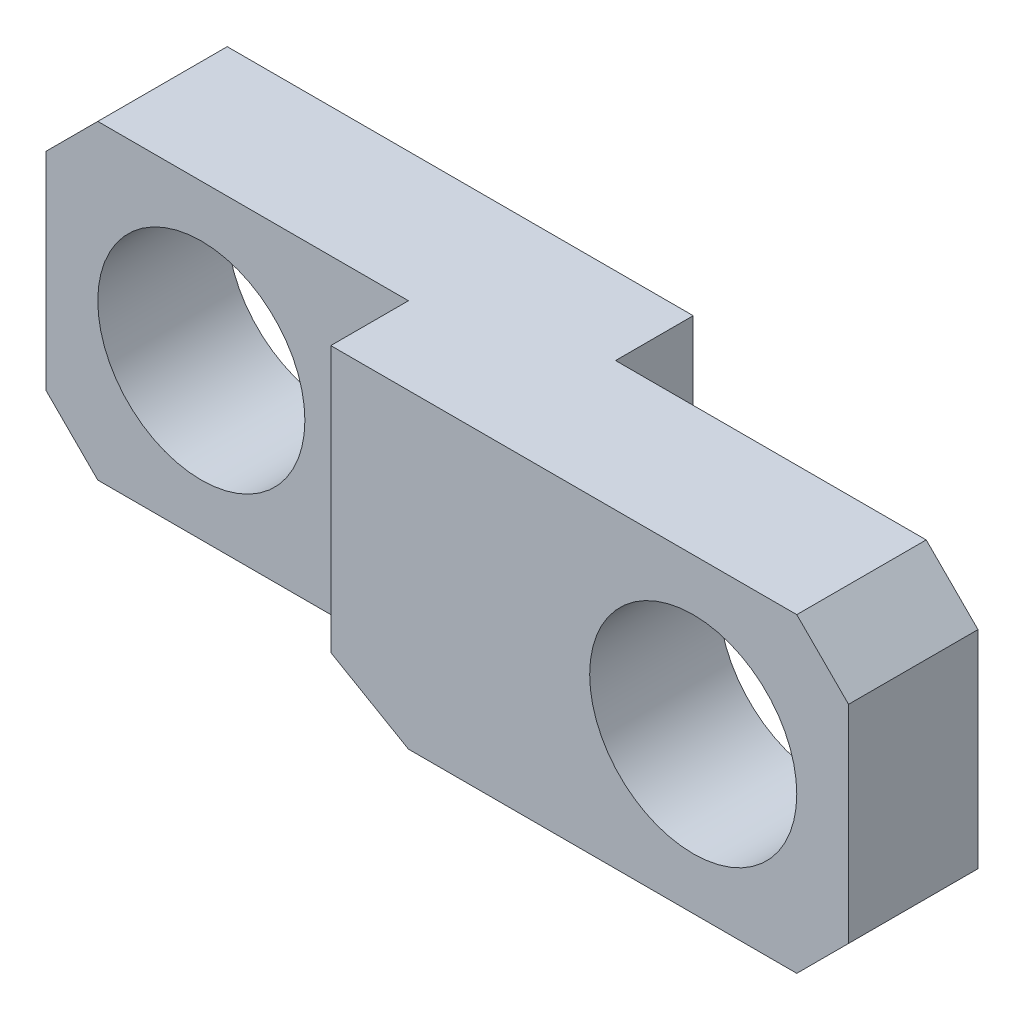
ISO-10303-21;
HEADER;
FILE_DESCRIPTION(('STEP AP214'),'2;1');
FILE_NAME('part.step','',(''),(''),'','','');
FILE_SCHEMA(('AUTOMOTIVE_DESIGN { 1 0 10303 214 1 1 1 1 }'));
ENDSEC;
DATA;
#1=APPLICATION_CONTEXT('core data for automotive mechanical design processes');
#2=APPLICATION_PROTOCOL_DEFINITION('international standard','automotive_design',2000,#1);
#3=PRODUCT_CONTEXT('',#1,'mechanical');
#4=PRODUCT('Part','Part','',(#3));
#5=PRODUCT_RELATED_PRODUCT_CATEGORY('part','',(#4));
#6=PRODUCT_DEFINITION_FORMATION('','',#4);
#7=PRODUCT_DEFINITION_CONTEXT('part definition',#1,'design');
#8=PRODUCT_DEFINITION('design','',#6,#7);
#9=PRODUCT_DEFINITION_SHAPE('','',#8);
#10=(LENGTH_UNIT() NAMED_UNIT(*) SI_UNIT(.MILLI.,.METRE.));
#11=(NAMED_UNIT(*) PLANE_ANGLE_UNIT() SI_UNIT($,.RADIAN.));
#12=(NAMED_UNIT(*) SI_UNIT($,.STERADIAN.) SOLID_ANGLE_UNIT());
#13=UNCERTAINTY_MEASURE_WITH_UNIT(LENGTH_MEASURE(1.E-05),#10,'distance_accuracy_value','');
#14=(GEOMETRIC_REPRESENTATION_CONTEXT(3) GLOBAL_UNCERTAINTY_ASSIGNED_CONTEXT((#13)) GLOBAL_UNIT_ASSIGNED_CONTEXT((#10,
#11,#12)) REPRESENTATION_CONTEXT('',''));
#15=CARTESIAN_POINT('',(0.,0.,0.));
#16=DIRECTION('',(0.,0.,1.));
#17=DIRECTION('',(1.,0.,0.));
#18=AXIS2_PLACEMENT_3D('',#15,#16,#17);
#19=CARTESIAN_POINT('',(-30.,30.,0.));
#20=DIRECTION('',(0.,0.,1.));
#21=DIRECTION('',(1.,0.,0.));
#22=AXIS2_PLACEMENT_3D('',#19,#20,#21);
#23=PLANE('',#22);
#24=CARTESIAN_POINT('',(-24.,24.,0.));
#25=DIRECTION('',(0.,0.,1.));
#26=DIRECTION('',(1.,0.,0.));
#27=AXIS2_PLACEMENT_3D('',#24,#25,#26);
#28=CIRCLE('',#27,4.);
#29=CARTESIAN_POINT('',(-20.,24.,0.));
#30=VERTEX_POINT('',#29);
#31=EDGE_CURVE('E225',#30,#30,#28,.T.);
#32=ORIENTED_EDGE('',*,*,#31,.T.);
#33=EDGE_LOOP('',(#32));
#34=FACE_BOUND('',#33,.T.);
#35=DIRECTION('',(0.,-1.,0.));
#36=VECTOR('',#35,1.);
#37=CARTESIAN_POINT('',(-10.,30.,0.));
#38=LINE('',#37,#36);
#39=CARTESIAN_POINT('',(-10.,30.,0.));
#40=VERTEX_POINT('',#39);
#41=CARTESIAN_POINT('',(-10.,18.,0.));
#42=VERTEX_POINT('',#41);
#43=EDGE_CURVE('E118',#40,#42,#38,.T.);
#44=ORIENTED_EDGE('',*,*,#43,.T.);
#45=DIRECTION('',(-1.,0.,0.));
#46=VECTOR('',#45,1.);
#47=CARTESIAN_POINT('',(4.,18.,0.));
#48=LINE('',#47,#46);
#49=CARTESIAN_POINT('',(-28.,18.,0.));
#50=VERTEX_POINT('',#49);
#51=EDGE_CURVE('E146',#42,#50,#48,.T.);
#52=ORIENTED_EDGE('',*,*,#51,.T.);
#53=DIRECTION('',(-0.707106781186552,0.707106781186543,0.));
#54=VECTOR('',#53,1.);
#55=CARTESIAN_POINT('',(-28.,18.,0.));
#56=LINE('',#55,#54);
#57=CARTESIAN_POINT('',(-30.,20.,0.));
#58=VERTEX_POINT('',#57);
#59=EDGE_CURVE('E180',#50,#58,#56,.T.);
#60=ORIENTED_EDGE('',*,*,#59,.T.);
#61=DIRECTION('',(0.,-1.,0.));
#62=VECTOR('',#61,1.);
#63=CARTESIAN_POINT('',(-30.,30.,0.));
#64=LINE('',#63,#62);
#65=CARTESIAN_POINT('',(-30.,28.,0.));
#66=VERTEX_POINT('',#65);
#67=EDGE_CURVE('E150',#66,#58,#64,.T.);
#68=ORIENTED_EDGE('',*,*,#67,.F.);
#69=DIRECTION('',(0.707106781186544,0.707106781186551,0.));
#70=VECTOR('',#69,1.);
#71=CARTESIAN_POINT('',(-30.,28.,0.));
#72=LINE('',#71,#70);
#73=CARTESIAN_POINT('',(-28.,30.,0.));
#74=VERTEX_POINT('',#73);
#75=EDGE_CURVE('E144',#66,#74,#72,.T.);
#76=ORIENTED_EDGE('',*,*,#75,.T.);
#77=DIRECTION('',(1.,0.,0.));
#78=VECTOR('',#77,1.);
#79=CARTESIAN_POINT('',(-30.,30.,0.));
#80=LINE('',#79,#78);
#81=EDGE_CURVE('E136',#74,#40,#80,.T.);
#82=ORIENTED_EDGE('',*,*,#81,.T.);
#83=EDGE_LOOP('',(#44,#52,#60,#68,#76,#82));
#84=FACE_BOUND('',#83,.T.);
#85=ADVANCED_FACE('F24',(#34,#84),#23,.F.);
#86=CARTESIAN_POINT('',(4.,18.,8.));
#87=DIRECTION('',(0.,-1.,0.));
#88=DIRECTION('',(1.,0.,0.));
#89=AXIS2_PLACEMENT_3D('',#86,#87,#88);
#90=PLANE('',#89);
#91=DIRECTION('',(-1.,0.,0.));
#92=VECTOR('',#91,1.);
#93=CARTESIAN_POINT('',(4.,18.,8.));
#94=LINE('',#93,#92);
#95=CARTESIAN_POINT('',(1.99999999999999,18.,8.));
#96=VERTEX_POINT('',#95);
#97=CARTESIAN_POINT('',(-13.,18.,8.));
#98=VERTEX_POINT('',#97);
#99=EDGE_CURVE('E145',#96,#98,#94,.T.);
#100=ORIENTED_EDGE('',*,*,#99,.T.);
#101=DIRECTION('',(0.,0.,-1.));
#102=VECTOR('',#101,1.);
#103=CARTESIAN_POINT('',(-13.,18.,5.));
#104=LINE('',#103,#102);
#105=CARTESIAN_POINT('',(-13.,18.,5.));
#106=VERTEX_POINT('',#105);
#107=EDGE_CURVE('E32',#98,#106,#104,.T.);
#108=ORIENTED_EDGE('',*,*,#107,.T.);
#109=DIRECTION('',(-1.,0.,0.));
#110=VECTOR('',#109,1.);
#111=CARTESIAN_POINT('',(-16.,18.,5.));
#112=LINE('',#111,#110);
#113=CARTESIAN_POINT('',(-28.,18.,5.));
#114=VERTEX_POINT('',#113);
#115=EDGE_CURVE('E38',#106,#114,#112,.T.);
#116=ORIENTED_EDGE('',*,*,#115,.T.);
#117=DIRECTION('',(0.,0.,-1.));
#118=VECTOR('',#117,1.);
#119=CARTESIAN_POINT('',(-28.,18.,0.));
#120=LINE('',#119,#118);
#121=EDGE_CURVE('E177',#114,#50,#120,.T.);
#122=ORIENTED_EDGE('',*,*,#121,.T.);
#123=ORIENTED_EDGE('',*,*,#51,.F.);
#124=DIRECTION('',(0.,0.,-1.));
#125=VECTOR('',#124,1.);
#126=CARTESIAN_POINT('',(-10.,18.,3.));
#127=LINE('',#126,#125);
#128=CARTESIAN_POINT('',(-10.,18.,3.));
#129=VERTEX_POINT('',#128);
#130=EDGE_CURVE('E125',#129,#42,#127,.T.);
#131=ORIENTED_EDGE('',*,*,#130,.F.);
#132=DIRECTION('',(-1.,0.,0.));
#133=VECTOR('',#132,1.);
#134=CARTESIAN_POINT('',(4.,18.,3.));
#135=LINE('',#134,#133);
#136=CARTESIAN_POINT('',(2.,18.,3.));
#137=VERTEX_POINT('',#136);
#138=EDGE_CURVE('E247',#137,#129,#135,.T.);
#139=ORIENTED_EDGE('',*,*,#138,.F.);
#140=DIRECTION('',(0.,0.,1.));
#141=VECTOR('',#140,1.);
#142=CARTESIAN_POINT('',(1.99999999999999,18.,8.));
#143=LINE('',#142,#141);
#144=EDGE_CURVE('E173',#137,#96,#143,.T.);
#145=ORIENTED_EDGE('',*,*,#144,.T.);
#146=EDGE_LOOP('',(#100,#108,#116,#122,#123,#131,#139,#145));
#147=FACE_BOUND('',#146,.T.);
#148=ADVANCED_FACE('F26',(#147),#90,.T.);
#149=CARTESIAN_POINT('',(4.,18.,8.));
#150=DIRECTION('',(-1.,0.,0.));
#151=DIRECTION('',(0.,0.,1.));
#152=AXIS2_PLACEMENT_3D('',#149,#150,#151);
#153=PLANE('',#152);
#154=DIRECTION('',(0.,1.,0.));
#155=VECTOR('',#154,1.);
#156=CARTESIAN_POINT('',(4.,18.,3.));
#157=LINE('',#156,#155);
#158=CARTESIAN_POINT('',(4.,20.,3.));
#159=VERTEX_POINT('',#158);
#160=CARTESIAN_POINT('',(4.,28.,3.));
#161=VERTEX_POINT('',#160);
#162=EDGE_CURVE('E129',#159,#161,#157,.T.);
#163=ORIENTED_EDGE('',*,*,#162,.T.);
#164=DIRECTION('',(0.,0.,1.));
#165=VECTOR('',#164,1.);
#166=CARTESIAN_POINT('',(4.,28.,8.));
#167=LINE('',#166,#165);
#168=CARTESIAN_POINT('',(4.,28.,8.));
#169=VERTEX_POINT('',#168);
#170=EDGE_CURVE('E166',#161,#169,#167,.T.);
#171=ORIENTED_EDGE('',*,*,#170,.T.);
#172=DIRECTION('',(0.,1.,0.));
#173=VECTOR('',#172,1.);
#174=CARTESIAN_POINT('',(4.,18.,8.));
#175=LINE('',#174,#173);
#176=CARTESIAN_POINT('',(4.,20.,8.));
#177=VERTEX_POINT('',#176);
#178=EDGE_CURVE('E148',#177,#169,#175,.T.);
#179=ORIENTED_EDGE('',*,*,#178,.F.);
#180=DIRECTION('',(0.,0.,-1.));
#181=VECTOR('',#180,1.);
#182=CARTESIAN_POINT('',(4.,20.,0.));
#183=LINE('',#182,#181);
#184=EDGE_CURVE('E163',#177,#159,#183,.T.);
#185=ORIENTED_EDGE('',*,*,#184,.T.);
#186=EDGE_LOOP('',(#163,#171,#179,#185));
#187=FACE_BOUND('',#186,.T.);
#188=ADVANCED_FACE('F255',(#187),#153,.F.);
#189=CARTESIAN_POINT('',(-30.,30.,8.));
#190=DIRECTION('',(0.,1.,0.));
#191=DIRECTION('',(0.,0.,1.));
#192=AXIS2_PLACEMENT_3D('',#189,#190,#191);
#193=PLANE('',#192);
#194=DIRECTION('',(1.,0.,0.));
#195=VECTOR('',#194,1.);
#196=CARTESIAN_POINT('',(-10.,30.,3.));
#197=LINE('',#196,#195);
#198=CARTESIAN_POINT('',(-10.,30.,3.));
#199=VERTEX_POINT('',#198);
#200=CARTESIAN_POINT('',(1.99999999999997,30.,3.));
#201=VERTEX_POINT('',#200);
#202=EDGE_CURVE('E139',#199,#201,#197,.T.);
#203=ORIENTED_EDGE('',*,*,#202,.F.);
#204=DIRECTION('',(0.,0.,-1.));
#205=VECTOR('',#204,1.);
#206=CARTESIAN_POINT('',(-10.,30.,3.));
#207=LINE('',#206,#205);
#208=EDGE_CURVE('E122',#199,#40,#207,.T.);
#209=ORIENTED_EDGE('',*,*,#208,.T.);
#210=ORIENTED_EDGE('',*,*,#81,.F.);
#211=DIRECTION('',(0.,0.,1.));
#212=VECTOR('',#211,1.);
#213=CARTESIAN_POINT('',(-28.,30.,8.));
#214=LINE('',#213,#212);
#215=CARTESIAN_POINT('',(-28.,30.,5.));
#216=VERTEX_POINT('',#215);
#217=EDGE_CURVE('E158',#74,#216,#214,.T.);
#218=ORIENTED_EDGE('',*,*,#217,.T.);
#219=DIRECTION('',(1.,0.,0.));
#220=VECTOR('',#219,1.);
#221=CARTESIAN_POINT('',(-30.,30.,5.));
#222=LINE('',#221,#220);
#223=CARTESIAN_POINT('',(-16.,30.,5.));
#224=VERTEX_POINT('',#223);
#225=EDGE_CURVE('E209',#216,#224,#222,.T.);
#226=ORIENTED_EDGE('',*,*,#225,.T.);
#227=DIRECTION('',(0.,0.,1.));
#228=VECTOR('',#227,1.);
#229=CARTESIAN_POINT('',(-16.,30.,5.));
#230=LINE('',#229,#228);
#231=CARTESIAN_POINT('',(-16.,30.,8.));
#232=VERTEX_POINT('',#231);
#233=EDGE_CURVE('E207',#224,#232,#230,.T.);
#234=ORIENTED_EDGE('',*,*,#233,.T.);
#235=DIRECTION('',(1.,0.,0.));
#236=VECTOR('',#235,1.);
#237=CARTESIAN_POINT('',(-30.,30.,8.));
#238=LINE('',#237,#236);
#239=CARTESIAN_POINT('',(1.99999999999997,30.,8.));
#240=VERTEX_POINT('',#239);
#241=EDGE_CURVE('E156',#232,#240,#238,.T.);
#242=ORIENTED_EDGE('',*,*,#241,.T.);
#243=DIRECTION('',(0.,0.,-1.));
#244=VECTOR('',#243,1.);
#245=CARTESIAN_POINT('',(1.99999999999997,30.,0.));
#246=LINE('',#245,#244);
#247=EDGE_CURVE('E160',#240,#201,#246,.T.);
#248=ORIENTED_EDGE('',*,*,#247,.T.);
#249=EDGE_LOOP('',(#203,#209,#210,#218,#226,#234,#242,#248));
#250=FACE_BOUND('',#249,.T.);
#251=ADVANCED_FACE('F134',(#250),#193,.T.);
#252=CARTESIAN_POINT('',(-2.,24.,8.));
#253=DIRECTION('',(0.,0.,-1.));
#254=DIRECTION('',(-1.,0.,0.));
#255=AXIS2_PLACEMENT_3D('',#252,#253,#254);
#256=CYLINDRICAL_SURFACE('',#255,4.);
#257=CARTESIAN_POINT('',(-2.,24.,8.));
#258=DIRECTION('',(0.,0.,1.));
#259=DIRECTION('',(1.,0.,0.));
#260=AXIS2_PLACEMENT_3D('',#257,#258,#259);
#261=CIRCLE('',#260,4.);
#262=CARTESIAN_POINT('',(2.,24.,8.));
#263=VERTEX_POINT('',#262);
#264=EDGE_CURVE('E222',#263,#263,#261,.T.);
#265=ORIENTED_EDGE('',*,*,#264,.T.);
#266=EDGE_LOOP('',(#265));
#267=FACE_BOUND('',#266,.T.);
#268=CARTESIAN_POINT('',(-2.,24.,3.));
#269=DIRECTION('',(0.,0.,-1.));
#270=DIRECTION('',(-1.,0.,0.));
#271=AXIS2_PLACEMENT_3D('',#268,#269,#270);
#272=CIRCLE('',#271,4.);
#273=CARTESIAN_POINT('',(-6.,24.,3.));
#274=VERTEX_POINT('',#273);
#275=EDGE_CURVE('E239',#274,#274,#272,.T.);
#276=ORIENTED_EDGE('',*,*,#275,.T.);
#277=EDGE_LOOP('',(#276));
#278=FACE_BOUND('',#277,.T.);
#279=ADVANCED_FACE('F297',(#267,#278),#256,.F.);
#280=CARTESIAN_POINT('',(1.99999999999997,30.,8.));
#281=DIRECTION('',(0.707106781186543,0.707106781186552,0.));
#282=DIRECTION('',(-0.707106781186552,0.707106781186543,0.));
#283=AXIS2_PLACEMENT_3D('',#280,#281,#282);
#284=PLANE('',#283);
#285=ORIENTED_EDGE('',*,*,#170,.F.);
#286=DIRECTION('',(-0.707106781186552,0.707106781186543,0.));
#287=VECTOR('',#286,1.);
#288=CARTESIAN_POINT('',(1.99999999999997,30.,3.));
#289=LINE('',#288,#287);
#290=EDGE_CURVE('E140',#161,#201,#289,.T.);
#291=ORIENTED_EDGE('',*,*,#290,.T.);
#292=ORIENTED_EDGE('',*,*,#247,.F.);
#293=DIRECTION('',(-0.707106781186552,0.707106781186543,0.));
#294=VECTOR('',#293,1.);
#295=CARTESIAN_POINT('',(-14.0000000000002,46.,8.));
#296=LINE('',#295,#294);
#297=EDGE_CURVE('E170',#169,#240,#296,.T.);
#298=ORIENTED_EDGE('',*,*,#297,.F.);
#299=EDGE_LOOP('',(#285,#291,#292,#298));
#300=FACE_BOUND('',#299,.T.);
#301=ADVANCED_FACE('F261',(#300),#284,.T.);
#302=CARTESIAN_POINT('',(4.,20.,8.));
#303=DIRECTION('',(0.707106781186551,-0.707106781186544,0.));
#304=DIRECTION('',(0.707106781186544,0.707106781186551,0.));
#305=AXIS2_PLACEMENT_3D('',#302,#303,#304);
#306=PLANE('',#305);
#307=ORIENTED_EDGE('',*,*,#144,.F.);
#308=DIRECTION('',(0.707106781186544,0.707106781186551,0.));
#309=VECTOR('',#308,1.);
#310=CARTESIAN_POINT('',(4.,20.,3.));
#311=LINE('',#310,#309);
#312=EDGE_CURVE('E187',#137,#159,#311,.T.);
#313=ORIENTED_EDGE('',*,*,#312,.T.);
#314=ORIENTED_EDGE('',*,*,#184,.F.);
#315=DIRECTION('',(0.707106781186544,0.707106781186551,0.));
#316=VECTOR('',#315,1.);
#317=CARTESIAN_POINT('',(-7.99999999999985,8.00000000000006,8.));
#318=LINE('',#317,#316);
#319=EDGE_CURVE('E168',#96,#177,#318,.T.);
#320=ORIENTED_EDGE('',*,*,#319,.F.);
#321=EDGE_LOOP('',(#307,#313,#314,#320));
#322=FACE_BOUND('',#321,.T.);
#323=ADVANCED_FACE('F269',(#322),#306,.T.);
#324=CARTESIAN_POINT('',(-30.,30.,8.));
#325=DIRECTION('',(0.,0.,1.));
#326=DIRECTION('',(1.,0.,0.));
#327=AXIS2_PLACEMENT_3D('',#324,#325,#326);
#328=PLANE('',#327);
#329=DIRECTION('',(0.,1.,0.));
#330=VECTOR('',#329,1.);
#331=CARTESIAN_POINT('',(-16.,18.,8.));
#332=LINE('',#331,#330);
#333=CARTESIAN_POINT('',(-16.,19.7320508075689,8.));
#334=VERTEX_POINT('',#333);
#335=EDGE_CURVE('E238',#334,#232,#332,.T.);
#336=ORIENTED_EDGE('',*,*,#335,.F.);
#337=DIRECTION('',(0.866025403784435,-0.500000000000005,0.));
#338=VECTOR('',#337,1.);
#339=CARTESIAN_POINT('',(-30.9461524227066,28.3612159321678,8.));
#340=LINE('',#339,#338);
#341=EDGE_CURVE('E46',#334,#98,#340,.T.);
#342=ORIENTED_EDGE('',*,*,#341,.T.);
#343=ORIENTED_EDGE('',*,*,#99,.F.);
#344=ORIENTED_EDGE('',*,*,#319,.T.);
#345=ORIENTED_EDGE('',*,*,#178,.T.);
#346=ORIENTED_EDGE('',*,*,#297,.T.);
#347=ORIENTED_EDGE('',*,*,#241,.F.);
#348=EDGE_LOOP('',(#336,#342,#343,#344,#345,#346,#347));
#349=FACE_BOUND('',#348,.T.);
#350=ORIENTED_EDGE('',*,*,#264,.F.);
#351=EDGE_LOOP('',(#350));
#352=FACE_BOUND('',#351,.T.);
#353=ADVANCED_FACE('F264',(#349,#352),#328,.T.);
#354=CARTESIAN_POINT('',(-30.,30.,8.));
#355=DIRECTION('',(1.,0.,0.));
#356=DIRECTION('',(0.,1.,0.));
#357=AXIS2_PLACEMENT_3D('',#354,#355,#356);
#358=PLANE('',#357);
#359=DIRECTION('',(0.,0.,1.));
#360=VECTOR('',#359,1.);
#361=CARTESIAN_POINT('',(-30.,20.,8.));
#362=LINE('',#361,#360);
#363=CARTESIAN_POINT('',(-30.,20.,5.));
#364=VERTEX_POINT('',#363);
#365=EDGE_CURVE('E182',#58,#364,#362,.T.);
#366=ORIENTED_EDGE('',*,*,#365,.T.);
#367=DIRECTION('',(0.,-1.,0.));
#368=VECTOR('',#367,1.);
#369=CARTESIAN_POINT('',(-30.,30.,5.));
#370=LINE('',#369,#368);
#371=CARTESIAN_POINT('',(-30.,28.,5.));
#372=VERTEX_POINT('',#371);
#373=EDGE_CURVE('E212',#372,#364,#370,.T.);
#374=ORIENTED_EDGE('',*,*,#373,.F.);
#375=DIRECTION('',(0.,0.,-1.));
#376=VECTOR('',#375,1.);
#377=CARTESIAN_POINT('',(-30.,28.,0.));
#378=LINE('',#377,#376);
#379=EDGE_CURVE('E175',#372,#66,#378,.T.);
#380=ORIENTED_EDGE('',*,*,#379,.T.);
#381=ORIENTED_EDGE('',*,*,#67,.T.);
#382=EDGE_LOOP('',(#366,#374,#380,#381));
#383=FACE_BOUND('',#382,.T.);
#384=ADVANCED_FACE('F230',(#383),#358,.F.);
#385=CARTESIAN_POINT('',(-24.,24.,8.));
#386=DIRECTION('',(0.,0.,-1.));
#387=DIRECTION('',(-1.,0.,0.));
#388=AXIS2_PLACEMENT_3D('',#385,#386,#387);
#389=CYLINDRICAL_SURFACE('',#388,4.);
#390=CARTESIAN_POINT('',(-24.,24.,5.));
#391=DIRECTION('',(0.,0.,-1.));
#392=DIRECTION('',(-1.,0.,0.));
#393=AXIS2_PLACEMENT_3D('',#390,#391,#392);
#394=CIRCLE('',#393,4.);
#395=CARTESIAN_POINT('',(-28.,24.,5.));
#396=VERTEX_POINT('',#395);
#397=EDGE_CURVE('E219',#396,#396,#394,.T.);
#398=ORIENTED_EDGE('',*,*,#397,.F.);
#399=EDGE_LOOP('',(#398));
#400=FACE_BOUND('',#399,.T.);
#401=ORIENTED_EDGE('',*,*,#31,.F.);
#402=EDGE_LOOP('',(#401));
#403=FACE_BOUND('',#402,.T.);
#404=ADVANCED_FACE('F290',(#400,#403),#389,.F.);
#405=CARTESIAN_POINT('',(-30.,28.,8.));
#406=DIRECTION('',(-0.707106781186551,0.707106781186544,0.));
#407=DIRECTION('',(-0.707106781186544,-0.707106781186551,0.));
#408=AXIS2_PLACEMENT_3D('',#405,#406,#407);
#409=PLANE('',#408);
#410=DIRECTION('',(-0.707106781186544,-0.707106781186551,0.));
#411=VECTOR('',#410,1.);
#412=CARTESIAN_POINT('',(-30.,28.,5.));
#413=LINE('',#412,#411);
#414=EDGE_CURVE('E217',#216,#372,#413,.T.);
#415=ORIENTED_EDGE('',*,*,#414,.F.);
#416=ORIENTED_EDGE('',*,*,#217,.F.);
#417=ORIENTED_EDGE('',*,*,#75,.F.);
#418=ORIENTED_EDGE('',*,*,#379,.F.);
#419=EDGE_LOOP('',(#415,#416,#417,#418));
#420=FACE_BOUND('',#419,.T.);
#421=ADVANCED_FACE('F340',(#420),#409,.T.);
#422=CARTESIAN_POINT('',(-28.,18.,8.));
#423=DIRECTION('',(-0.707106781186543,-0.707106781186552,0.));
#424=DIRECTION('',(0.707106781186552,-0.707106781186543,0.));
#425=AXIS2_PLACEMENT_3D('',#422,#423,#424);
#426=PLANE('',#425);
#427=DIRECTION('',(0.707106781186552,-0.707106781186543,0.));
#428=VECTOR('',#427,1.);
#429=CARTESIAN_POINT('',(-28.,18.,5.));
#430=LINE('',#429,#428);
#431=EDGE_CURVE('E185',#364,#114,#430,.T.);
#432=ORIENTED_EDGE('',*,*,#431,.F.);
#433=ORIENTED_EDGE('',*,*,#365,.F.);
#434=ORIENTED_EDGE('',*,*,#59,.F.);
#435=ORIENTED_EDGE('',*,*,#121,.F.);
#436=EDGE_LOOP('',(#432,#433,#434,#435));
#437=FACE_BOUND('',#436,.T.);
#438=ADVANCED_FACE('F236',(#437),#426,.T.);
#439=CARTESIAN_POINT('',(-16.,18.,5.));
#440=DIRECTION('',(1.,0.,0.));
#441=DIRECTION('',(0.,0.,-1.));
#442=AXIS2_PLACEMENT_3D('',#439,#440,#441);
#443=PLANE('',#442);
#444=DIRECTION('',(0.,1.,0.));
#445=VECTOR('',#444,1.);
#446=CARTESIAN_POINT('',(-16.,18.,5.));
#447=LINE('',#446,#445);
#448=CARTESIAN_POINT('',(-16.,19.7320508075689,5.));
#449=VERTEX_POINT('',#448);
#450=EDGE_CURVE('E202',#449,#224,#447,.T.);
#451=ORIENTED_EDGE('',*,*,#450,.F.);
#452=DIRECTION('',(0.,0.,1.));
#453=VECTOR('',#452,1.);
#454=CARTESIAN_POINT('',(-16.,19.7320508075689,8.));
#455=LINE('',#454,#453);
#456=EDGE_CURVE('E190',#449,#334,#455,.T.);
#457=ORIENTED_EDGE('',*,*,#456,.T.);
#458=ORIENTED_EDGE('',*,*,#335,.T.);
#459=ORIENTED_EDGE('',*,*,#233,.F.);
#460=EDGE_LOOP('',(#451,#457,#458,#459));
#461=FACE_BOUND('',#460,.T.);
#462=ADVANCED_FACE('F205',(#461),#443,.F.);
#463=CARTESIAN_POINT('',(-30.,18.,5.));
#464=DIRECTION('',(0.,0.,-1.));
#465=DIRECTION('',(-1.,0.,0.));
#466=AXIS2_PLACEMENT_3D('',#463,#464,#465);
#467=PLANE('',#466);
#468=ORIENTED_EDGE('',*,*,#397,.T.);
#469=EDGE_LOOP('',(#468));
#470=FACE_BOUND('',#469,.T.);
#471=ORIENTED_EDGE('',*,*,#414,.T.);
#472=ORIENTED_EDGE('',*,*,#373,.T.);
#473=ORIENTED_EDGE('',*,*,#431,.T.);
#474=ORIENTED_EDGE('',*,*,#115,.F.);
#475=DIRECTION('',(-0.866025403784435,0.500000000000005,0.));
#476=VECTOR('',#475,1.);
#477=CARTESIAN_POINT('',(-25.7499999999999,25.3612159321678,5.));
#478=LINE('',#477,#476);
#479=EDGE_CURVE('E11',#106,#449,#478,.T.);
#480=ORIENTED_EDGE('',*,*,#479,.T.);
#481=ORIENTED_EDGE('',*,*,#450,.T.);
#482=ORIENTED_EDGE('',*,*,#225,.F.);
#483=EDGE_LOOP('',(#471,#472,#473,#474,#480,#481,#482));
#484=FACE_BOUND('',#483,.T.);
#485=ADVANCED_FACE('F201',(#470,#484),#467,.F.);
#486=CARTESIAN_POINT('',(-10.,30.,3.));
#487=DIRECTION('',(1.,0.,0.));
#488=DIRECTION('',(0.,0.,-1.));
#489=AXIS2_PLACEMENT_3D('',#486,#487,#488);
#490=PLANE('',#489);
#491=ORIENTED_EDGE('',*,*,#130,.T.);
#492=ORIENTED_EDGE('',*,*,#43,.F.);
#493=ORIENTED_EDGE('',*,*,#208,.F.);
#494=DIRECTION('',(0.,-1.,0.));
#495=VECTOR('',#494,1.);
#496=CARTESIAN_POINT('',(-10.,30.,3.));
#497=LINE('',#496,#495);
#498=EDGE_CURVE('E249',#199,#129,#497,.T.);
#499=ORIENTED_EDGE('',*,*,#498,.T.);
#500=EDGE_LOOP('',(#491,#492,#493,#499));
#501=FACE_BOUND('',#500,.T.);
#502=ADVANCED_FACE('F120',(#501),#490,.T.);
#503=CARTESIAN_POINT('',(4.,30.,3.));
#504=DIRECTION('',(0.,0.,-1.));
#505=DIRECTION('',(-1.,0.,0.));
#506=AXIS2_PLACEMENT_3D('',#503,#504,#505);
#507=PLANE('',#506);
#508=ORIENTED_EDGE('',*,*,#275,.F.);
#509=EDGE_LOOP('',(#508));
#510=FACE_BOUND('',#509,.T.);
#511=ORIENTED_EDGE('',*,*,#162,.F.);
#512=ORIENTED_EDGE('',*,*,#312,.F.);
#513=ORIENTED_EDGE('',*,*,#138,.T.);
#514=ORIENTED_EDGE('',*,*,#498,.F.);
#515=ORIENTED_EDGE('',*,*,#202,.T.);
#516=ORIENTED_EDGE('',*,*,#290,.F.);
#517=EDGE_LOOP('',(#511,#512,#513,#514,#515,#516));
#518=FACE_BOUND('',#517,.T.);
#519=ADVANCED_FACE('F271',(#510,#518),#507,.T.);
#520=CARTESIAN_POINT('',(-16.,19.7320508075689,5.));
#521=DIRECTION('',(-0.500000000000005,-0.866025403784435,0.));
#522=DIRECTION('',(0.866025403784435,-0.500000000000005,0.));
#523=AXIS2_PLACEMENT_3D('',#520,#521,#522);
#524=PLANE('',#523);
#525=ORIENTED_EDGE('',*,*,#479,.F.);
#526=ORIENTED_EDGE('',*,*,#107,.F.);
#527=ORIENTED_EDGE('',*,*,#341,.F.);
#528=ORIENTED_EDGE('',*,*,#456,.F.);
#529=EDGE_LOOP('',(#525,#526,#527,#528));
#530=FACE_BOUND('',#529,.T.);
#531=ADVANCED_FACE('F199',(#530),#524,.T.);
#532=CLOSED_SHELL('',(#85,#148,#188,#251,#279,#301,#323,#353,#384,#404,#421,#438,#462,#485,#502,
#519,#531));
#533=MANIFOLD_SOLID_BREP('B2',#532);
#534=ADVANCED_BREP_SHAPE_REPRESENTATION('',(#18,#533),#14);
#535=SHAPE_DEFINITION_REPRESENTATION(#9,#534);
ENDSEC;
END-ISO-10303-21;
